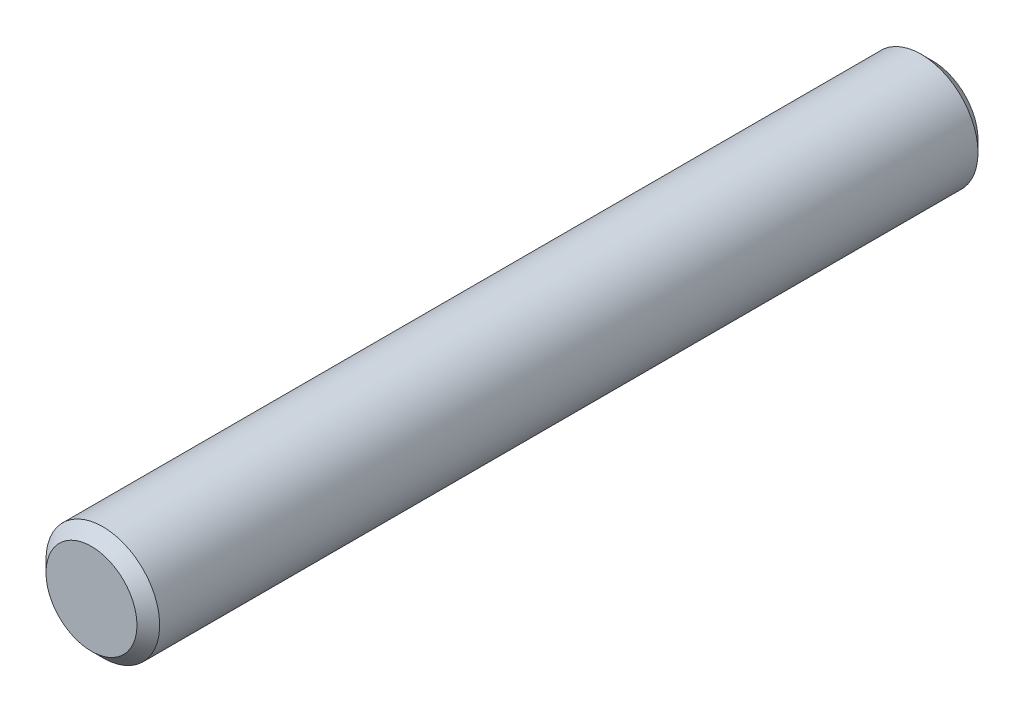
ISO-10303-21;
HEADER;
FILE_DESCRIPTION(('STEP AP214'),'2;1');
FILE_NAME('part.step','',(''),(''),'','','');
FILE_SCHEMA(('AUTOMOTIVE_DESIGN { 1 0 10303 214 1 1 1 1 }'));
ENDSEC;
DATA;
#1=APPLICATION_CONTEXT('core data for automotive mechanical design processes');
#2=APPLICATION_PROTOCOL_DEFINITION('international standard','automotive_design',2000,#1);
#3=PRODUCT_CONTEXT('',#1,'mechanical');
#4=PRODUCT('Part','Part','',(#3));
#5=PRODUCT_RELATED_PRODUCT_CATEGORY('part','',(#4));
#6=PRODUCT_DEFINITION_FORMATION('','',#4);
#7=PRODUCT_DEFINITION_CONTEXT('part definition',#1,'design');
#8=PRODUCT_DEFINITION('design','',#6,#7);
#9=PRODUCT_DEFINITION_SHAPE('','',#8);
#10=(LENGTH_UNIT() NAMED_UNIT(*) SI_UNIT(.MILLI.,.METRE.));
#11=(NAMED_UNIT(*) PLANE_ANGLE_UNIT() SI_UNIT($,.RADIAN.));
#12=(NAMED_UNIT(*) SI_UNIT($,.STERADIAN.) SOLID_ANGLE_UNIT());
#13=UNCERTAINTY_MEASURE_WITH_UNIT(LENGTH_MEASURE(1.E-05),#10,'distance_accuracy_value','');
#14=(GEOMETRIC_REPRESENTATION_CONTEXT(3) GLOBAL_UNCERTAINTY_ASSIGNED_CONTEXT((#13)) GLOBAL_UNIT_ASSIGNED_CONTEXT((#10,
#11,#12)) REPRESENTATION_CONTEXT('',''));
#15=CARTESIAN_POINT('',(0.,0.,0.));
#16=DIRECTION('',(0.,0.,1.));
#17=DIRECTION('',(1.,0.,0.));
#18=AXIS2_PLACEMENT_3D('',#15,#16,#17);
#19=CARTESIAN_POINT('',(21.3892111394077,-12.75,0.));
#20=DIRECTION('',(0.,0.,1.));
#21=DIRECTION('',(1.,0.,0.));
#22=AXIS2_PLACEMENT_3D('',#19,#20,#21);
#23=PLANE('',#22);
#24=CARTESIAN_POINT('',(21.3892111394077,-12.75,0.));
#25=DIRECTION('',(0.,0.,1.));
#26=DIRECTION('',(1.,0.,0.));
#27=AXIS2_PLACEMENT_3D('',#24,#25,#26);
#28=CIRCLE('',#27,1.);
#29=CARTESIAN_POINT('',(22.3892111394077,-12.75,0.));
#30=VERTEX_POINT('',#29);
#31=EDGE_CURVE('E10',#30,#30,#28,.F.);
#32=ORIENTED_EDGE('',*,*,#31,.T.);
#33=EDGE_LOOP('',(#32));
#34=FACE_BOUND('',#33,.T.);
#35=ADVANCED_FACE('F28',(#34),#23,.F.);
#36=CARTESIAN_POINT('',(21.3892111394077,-12.75,22.0355339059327));
#37=DIRECTION('',(0.,0.,-1.));
#38=DIRECTION('',(-1.,0.,0.));
#39=AXIS2_PLACEMENT_3D('',#36,#37,#38);
#40=CYLINDRICAL_SURFACE('',#39,1.25);
#41=CARTESIAN_POINT('',(21.3892111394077,-12.75,18.25));
#42=DIRECTION('',(0.,0.,-1.));
#43=DIRECTION('',(-1.,0.,0.));
#44=AXIS2_PLACEMENT_3D('',#41,#42,#43);
#45=CIRCLE('',#44,1.25);
#46=CARTESIAN_POINT('',(20.1392111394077,-12.75,18.25));
#47=VERTEX_POINT('',#46);
#48=EDGE_CURVE('E39',#47,#47,#45,.T.);
#49=ORIENTED_EDGE('',*,*,#48,.T.);
#50=EDGE_LOOP('',(#49));
#51=FACE_BOUND('',#50,.T.);
#52=CARTESIAN_POINT('',(21.3892111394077,-12.75,0.250000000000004));
#53=DIRECTION('',(0.,0.,1.));
#54=DIRECTION('',(1.,0.,0.));
#55=AXIS2_PLACEMENT_3D('',#52,#53,#54);
#56=CIRCLE('',#55,1.25);
#57=CARTESIAN_POINT('',(22.6392111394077,-12.75,0.250000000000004));
#58=VERTEX_POINT('',#57);
#59=EDGE_CURVE('E43',#58,#58,#56,.T.);
#60=ORIENTED_EDGE('',*,*,#59,.T.);
#61=EDGE_LOOP('',(#60));
#62=FACE_BOUND('',#61,.T.);
#63=ADVANCED_FACE('F30',(#51,#62),#40,.T.);
#64=CARTESIAN_POINT('',(41.4981401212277,-18.1154839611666,18.5));
#65=DIRECTION('',(0.,0.,-1.));
#66=DIRECTION('',(-1.,0.,0.));
#67=AXIS2_PLACEMENT_3D('',#64,#65,#66);
#68=PLANE('',#67);
#69=CARTESIAN_POINT('',(21.3892111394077,-12.75,18.5));
#70=DIRECTION('',(0.,0.,-1.));
#71=DIRECTION('',(-1.,0.,0.));
#72=AXIS2_PLACEMENT_3D('',#69,#70,#71);
#73=CIRCLE('',#72,1.);
#74=CARTESIAN_POINT('',(20.3892111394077,-12.75,18.5));
#75=VERTEX_POINT('',#74);
#76=EDGE_CURVE('E35',#75,#75,#73,.F.);
#77=ORIENTED_EDGE('',*,*,#76,.T.);
#78=EDGE_LOOP('',(#77));
#79=FACE_BOUND('',#78,.T.);
#80=ADVANCED_FACE('F58',(#79),#68,.F.);
#81=CARTESIAN_POINT('',(21.3892111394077,-12.75,18.25));
#82=DIRECTION('',(0.,0.,-1.));
#83=DIRECTION('',(-1.,0.,0.));
#84=AXIS2_PLACEMENT_3D('',#81,#82,#83);
#85=CONICAL_SURFACE('',#84,1.25,0.785398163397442);
#86=ORIENTED_EDGE('',*,*,#76,.F.);
#87=EDGE_LOOP('',(#86));
#88=FACE_BOUND('',#87,.T.);
#89=ORIENTED_EDGE('',*,*,#48,.F.);
#90=EDGE_LOOP('',(#89));
#91=FACE_BOUND('',#90,.T.);
#92=ADVANCED_FACE('F52',(#88,#91),#85,.T.);
#93=CARTESIAN_POINT('',(21.3892111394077,-12.75,0.250000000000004));
#94=DIRECTION('',(0.,0.,1.));
#95=DIRECTION('',(1.,0.,0.));
#96=AXIS2_PLACEMENT_3D('',#93,#94,#95);
#97=CONICAL_SURFACE('',#96,1.25,0.785398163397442);
#98=ORIENTED_EDGE('',*,*,#31,.F.);
#99=EDGE_LOOP('',(#98));
#100=FACE_BOUND('',#99,.T.);
#101=ORIENTED_EDGE('',*,*,#59,.F.);
#102=EDGE_LOOP('',(#101));
#103=FACE_BOUND('',#102,.T.);
#104=ADVANCED_FACE('F50',(#100,#103),#97,.T.);
#105=CLOSED_SHELL('',(#35,#63,#80,#92,#104));
#106=MANIFOLD_SOLID_BREP('B2',#105);
#107=ADVANCED_BREP_SHAPE_REPRESENTATION('',(#18,#106),#14);
#108=SHAPE_DEFINITION_REPRESENTATION(#9,#107);
ENDSEC;
END-ISO-10303-21;
